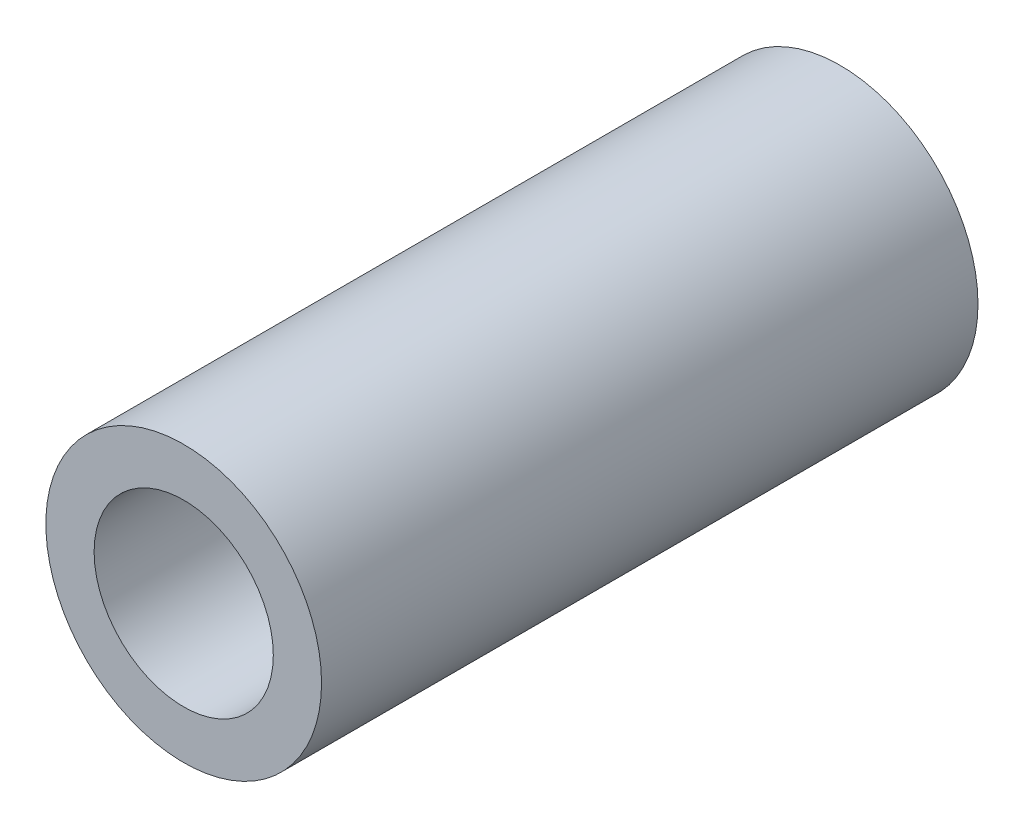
ISO-10303-21;
HEADER;
FILE_DESCRIPTION(('STEP AP214'),'2;1');
FILE_NAME('part.step','',(''),(''),'','','');
FILE_SCHEMA(('AUTOMOTIVE_DESIGN { 1 0 10303 214 1 1 1 1 }'));
ENDSEC;
DATA;
#1=APPLICATION_CONTEXT('core data for automotive mechanical design processes');
#2=APPLICATION_PROTOCOL_DEFINITION('international standard','automotive_design',2000,#1);
#3=PRODUCT_CONTEXT('',#1,'mechanical');
#4=PRODUCT('Part','Part','',(#3));
#5=PRODUCT_RELATED_PRODUCT_CATEGORY('part','',(#4));
#6=PRODUCT_DEFINITION_FORMATION('','',#4);
#7=PRODUCT_DEFINITION_CONTEXT('part definition',#1,'design');
#8=PRODUCT_DEFINITION('design','',#6,#7);
#9=PRODUCT_DEFINITION_SHAPE('','',#8);
#10=(LENGTH_UNIT() NAMED_UNIT(*) SI_UNIT(.MILLI.,.METRE.));
#11=(NAMED_UNIT(*) PLANE_ANGLE_UNIT() SI_UNIT($,.RADIAN.));
#12=(NAMED_UNIT(*) SI_UNIT($,.STERADIAN.) SOLID_ANGLE_UNIT());
#13=UNCERTAINTY_MEASURE_WITH_UNIT(LENGTH_MEASURE(1.E-05),#10,'distance_accuracy_value','');
#14=(GEOMETRIC_REPRESENTATION_CONTEXT(3) GLOBAL_UNCERTAINTY_ASSIGNED_CONTEXT((#13)) GLOBAL_UNIT_ASSIGNED_CONTEXT((#10,
#11,#12)) REPRESENTATION_CONTEXT('',''));
#15=CARTESIAN_POINT('',(0.,0.,0.));
#16=DIRECTION('',(0.,0.,1.));
#17=DIRECTION('',(1.,0.,0.));
#18=AXIS2_PLACEMENT_3D('',#15,#16,#17);
#19=CARTESIAN_POINT('',(0.,0.,50.8));
#20=DIRECTION('',(0.,0.,1.));
#21=DIRECTION('',(1.,0.,0.));
#22=AXIS2_PLACEMENT_3D('',#19,#20,#21);
#23=PLANE('',#22);
#24=CARTESIAN_POINT('',(0.,0.,50.8));
#25=DIRECTION('',(0.,0.,1.));
#26=DIRECTION('',(1.,0.,0.));
#27=AXIS2_PLACEMENT_3D('',#24,#25,#26);
#28=CIRCLE('',#27,10.668);
#29=CARTESIAN_POINT('',(10.668,0.,50.8));
#30=VERTEX_POINT('',#29);
#31=EDGE_CURVE('E10',#30,#30,#28,.T.);
#32=ORIENTED_EDGE('',*,*,#31,.T.);
#33=EDGE_LOOP('',(#32));
#34=FACE_BOUND('',#33,.T.);
#35=CARTESIAN_POINT('',(0.,0.,50.8));
#36=DIRECTION('',(0.,0.,1.));
#37=DIRECTION('',(1.,0.,0.));
#38=AXIS2_PLACEMENT_3D('',#35,#36,#37);
#39=CIRCLE('',#38,6.9342);
#40=CARTESIAN_POINT('',(6.9342,0.,50.8));
#41=VERTEX_POINT('',#40);
#42=EDGE_CURVE('E39',#41,#41,#39,.T.);
#43=ORIENTED_EDGE('',*,*,#42,.F.);
#44=EDGE_LOOP('',(#43));
#45=FACE_BOUND('',#44,.T.);
#46=ADVANCED_FACE('F28',(#34,#45),#23,.T.);
#47=CARTESIAN_POINT('',(0.,0.,0.));
#48=DIRECTION('',(0.,0.,1.));
#49=DIRECTION('',(1.,0.,0.));
#50=AXIS2_PLACEMENT_3D('',#47,#48,#49);
#51=PLANE('',#50);
#52=CARTESIAN_POINT('',(0.,0.,0.));
#53=DIRECTION('',(0.,0.,1.));
#54=DIRECTION('',(1.,0.,0.));
#55=AXIS2_PLACEMENT_3D('',#52,#53,#54);
#56=CIRCLE('',#55,10.668);
#57=CARTESIAN_POINT('',(10.668,0.,0.));
#58=VERTEX_POINT('',#57);
#59=EDGE_CURVE('E35',#58,#58,#56,.T.);
#60=ORIENTED_EDGE('',*,*,#59,.F.);
#61=EDGE_LOOP('',(#60));
#62=FACE_BOUND('',#61,.T.);
#63=CARTESIAN_POINT('',(0.,0.,0.));
#64=DIRECTION('',(0.,0.,1.));
#65=DIRECTION('',(1.,0.,0.));
#66=AXIS2_PLACEMENT_3D('',#63,#64,#65);
#67=CIRCLE('',#66,6.9342);
#68=CARTESIAN_POINT('',(6.9342,0.,0.));
#69=VERTEX_POINT('',#68);
#70=EDGE_CURVE('E43',#69,#69,#67,.T.);
#71=ORIENTED_EDGE('',*,*,#70,.T.);
#72=EDGE_LOOP('',(#71));
#73=FACE_BOUND('',#72,.T.);
#74=ADVANCED_FACE('F49',(#62,#73),#51,.F.);
#75=CARTESIAN_POINT('',(0.,0.,50.8));
#76=DIRECTION('',(0.,0.,-1.));
#77=DIRECTION('',(-1.,0.,0.));
#78=AXIS2_PLACEMENT_3D('',#75,#76,#77);
#79=CYLINDRICAL_SURFACE('',#78,10.668);
#80=ORIENTED_EDGE('',*,*,#31,.F.);
#81=EDGE_LOOP('',(#80));
#82=FACE_BOUND('',#81,.T.);
#83=ORIENTED_EDGE('',*,*,#59,.T.);
#84=EDGE_LOOP('',(#83));
#85=FACE_BOUND('',#84,.T.);
#86=ADVANCED_FACE('F30',(#82,#85),#79,.T.);
#87=CARTESIAN_POINT('',(0.,0.,50.8));
#88=DIRECTION('',(0.,0.,-1.));
#89=DIRECTION('',(-1.,0.,0.));
#90=AXIS2_PLACEMENT_3D('',#87,#88,#89);
#91=CYLINDRICAL_SURFACE('',#90,6.9342);
#92=ORIENTED_EDGE('',*,*,#42,.T.);
#93=EDGE_LOOP('',(#92));
#94=FACE_BOUND('',#93,.T.);
#95=ORIENTED_EDGE('',*,*,#70,.F.);
#96=EDGE_LOOP('',(#95));
#97=FACE_BOUND('',#96,.T.);
#98=ADVANCED_FACE('F51',(#94,#97),#91,.F.);
#99=CLOSED_SHELL('',(#46,#74,#86,#98));
#100=MANIFOLD_SOLID_BREP('B2',#99);
#101=ADVANCED_BREP_SHAPE_REPRESENTATION('',(#18,#100),#14);
#102=SHAPE_DEFINITION_REPRESENTATION(#9,#101);
ENDSEC;
END-ISO-10303-21;
